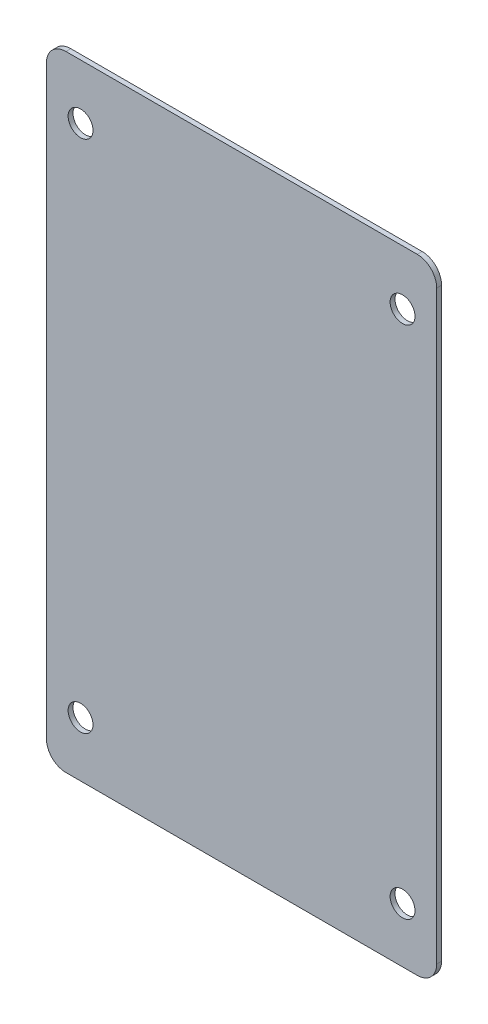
from build123d import *

# Parameters (mm, degrees)
SKETCH1_W           = 80
SKETCH1_H           = 128
BOSS_EXTRUDE1_DEPTH = 1
FILLET1_R           = 4
SKETCH2_R           = 2.55
CUT_EXTRUDE1_DEPTH  = 76.478473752


with BuildPart() as part:
    # Sketch1 → Boss-Extrude1 (new body)
    with BuildSketch(Plane.XY):
        Rectangle(SKETCH1_W, SKETCH1_H)
    extrude(amount=BOSS_EXTRUDE1_DEPTH)

    # Fillet1
    fillet1_edges = [part.edges().sort_by_distance(p)[0] for p in [
        (40, -64, 0.5),
        (-40, -64, 0.5),
        (-40, 64, 0.5),
        (40, 64, 0.5),
    ]]
    fillet(fillet1_edges, radius=FILLET1_R)

    # Sketch2 → Cut-Extrude1 (cut, through all)
    with BuildSketch(Plane(origin=(0, 0, 0), x_dir=(-1, 0, 0), z_dir=(0, 0, -1))):
        with Locations((-33, -52.75)):
            Circle(SKETCH2_R)
        with Locations((-33, 52.75)):
            Circle(SKETCH2_R)
        with Locations((33, 52.75)):
            Circle(SKETCH2_R)
        with Locations((33, -52.75)):
            Circle(SKETCH2_R)
    extrude(amount=-CUT_EXTRUDE1_DEPTH, mode=Mode.SUBTRACT)


solid = part.part
